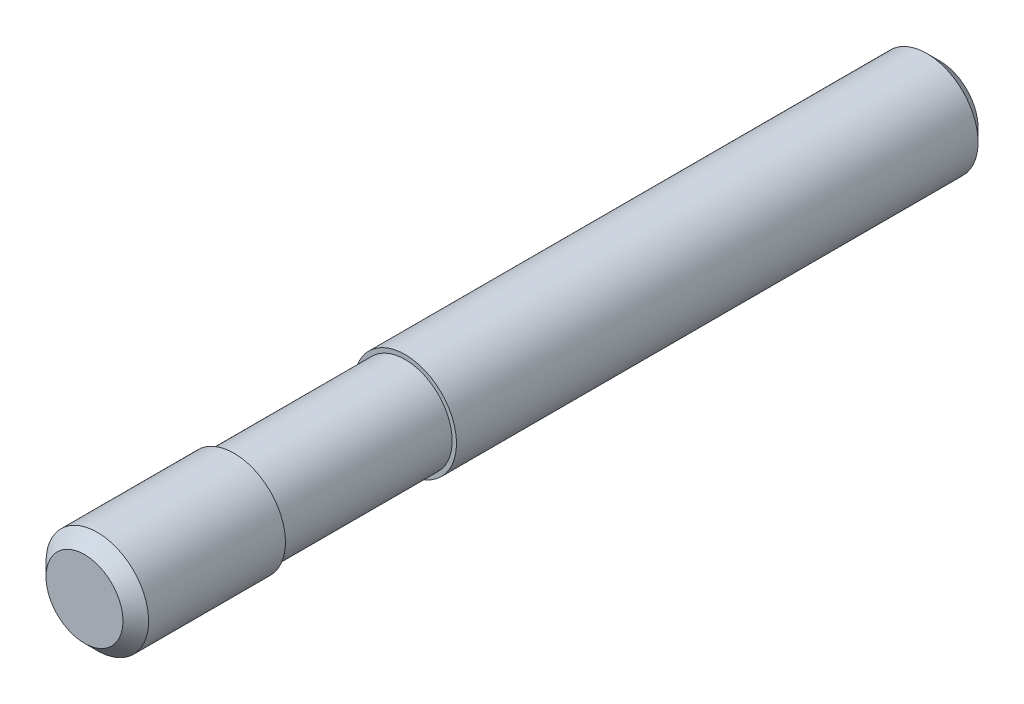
ISO-10303-21;
HEADER;
FILE_DESCRIPTION(('STEP AP214'),'2;1');
FILE_NAME('part.step','',(''),(''),'','','');
FILE_SCHEMA(('AUTOMOTIVE_DESIGN { 1 0 10303 214 1 1 1 1 }'));
ENDSEC;
DATA;
#1=APPLICATION_CONTEXT('core data for automotive mechanical design processes');
#2=APPLICATION_PROTOCOL_DEFINITION('international standard','automotive_design',2000,#1);
#3=PRODUCT_CONTEXT('',#1,'mechanical');
#4=PRODUCT('Part','Part','',(#3));
#5=PRODUCT_RELATED_PRODUCT_CATEGORY('part','',(#4));
#6=PRODUCT_DEFINITION_FORMATION('','',#4);
#7=PRODUCT_DEFINITION_CONTEXT('part definition',#1,'design');
#8=PRODUCT_DEFINITION('design','',#6,#7);
#9=PRODUCT_DEFINITION_SHAPE('','',#8);
#10=(LENGTH_UNIT() NAMED_UNIT(*) SI_UNIT(.MILLI.,.METRE.));
#11=(NAMED_UNIT(*) PLANE_ANGLE_UNIT() SI_UNIT($,.RADIAN.));
#12=(NAMED_UNIT(*) SI_UNIT($,.STERADIAN.) SOLID_ANGLE_UNIT());
#13=UNCERTAINTY_MEASURE_WITH_UNIT(LENGTH_MEASURE(1.E-05),#10,'distance_accuracy_value','');
#14=(GEOMETRIC_REPRESENTATION_CONTEXT(3) GLOBAL_UNCERTAINTY_ASSIGNED_CONTEXT((#13)) GLOBAL_UNIT_ASSIGNED_CONTEXT((#10,
#11,#12)) REPRESENTATION_CONTEXT('',''));
#15=CARTESIAN_POINT('',(0.,0.,0.));
#16=DIRECTION('',(0.,0.,1.));
#17=DIRECTION('',(1.,0.,0.));
#18=AXIS2_PLACEMENT_3D('',#15,#16,#17);
#19=CARTESIAN_POINT('',(-9.,0.,0.));
#20=DIRECTION('',(0.,0.,-1.));
#21=DIRECTION('',(-1.,0.,0.));
#22=AXIS2_PLACEMENT_3D('',#19,#20,#21);
#23=PLANE('',#22);
#24=CARTESIAN_POINT('',(0.,0.,0.));
#25=DIRECTION('',(0.,0.,-1.));
#26=DIRECTION('',(-1.,0.,0.));
#27=AXIS2_PLACEMENT_3D('',#24,#25,#26);
#28=CIRCLE('',#27,9.);
#29=CARTESIAN_POINT('',(-9.,0.,0.));
#30=VERTEX_POINT('',#29);
#31=EDGE_CURVE('E8',#30,#30,#28,.T.);
#32=ORIENTED_EDGE('',*,*,#31,.T.);
#33=EDGE_LOOP('',(#32));
#34=FACE_BOUND('',#33,.T.);
#35=ADVANCED_FACE('F12',(#34),#23,.T.);
#36=CARTESIAN_POINT('',(0.,0.,0.));
#37=DIRECTION('',(0.,0.,1.));
#38=DIRECTION('',(1.,0.,0.));
#39=AXIS2_PLACEMENT_3D('',#36,#37,#38);
#40=CONICAL_SURFACE('',#39,9.,0.785398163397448);
#41=CARTESIAN_POINT('',(0.,0.,3.));
#42=DIRECTION('',(0.,0.,-1.));
#43=DIRECTION('',(-1.,0.,0.));
#44=AXIS2_PLACEMENT_3D('',#41,#42,#43);
#45=CIRCLE('',#44,12.);
#46=CARTESIAN_POINT('',(-12.,0.,3.));
#47=VERTEX_POINT('',#46);
#48=EDGE_CURVE('E18',#47,#47,#45,.T.);
#49=ORIENTED_EDGE('',*,*,#48,.T.);
#50=EDGE_LOOP('',(#49));
#51=FACE_BOUND('',#50,.T.);
#52=ORIENTED_EDGE('',*,*,#31,.F.);
#53=EDGE_LOOP('',(#52));
#54=FACE_BOUND('',#53,.T.);
#55=ADVANCED_FACE('F57',(#51,#54),#40,.T.);
#56=CARTESIAN_POINT('',(0.,0.,0.));
#57=DIRECTION('',(0.,0.,-1.));
#58=DIRECTION('',(-1.,0.,0.));
#59=AXIS2_PLACEMENT_3D('',#56,#57,#58);
#60=CYLINDRICAL_SURFACE('',#59,12.);
#61=CARTESIAN_POINT('',(0.,0.,125.));
#62=DIRECTION('',(0.,0.,-1.));
#63=DIRECTION('',(-1.,0.,0.));
#64=AXIS2_PLACEMENT_3D('',#61,#62,#63);
#65=CIRCLE('',#64,12.);
#66=CARTESIAN_POINT('',(-12.,0.,125.));
#67=VERTEX_POINT('',#66);
#68=EDGE_CURVE('E22',#67,#67,#65,.T.);
#69=ORIENTED_EDGE('',*,*,#68,.T.);
#70=EDGE_LOOP('',(#69));
#71=FACE_BOUND('',#70,.T.);
#72=ORIENTED_EDGE('',*,*,#48,.F.);
#73=EDGE_LOOP('',(#72));
#74=FACE_BOUND('',#73,.T.);
#75=ADVANCED_FACE('F61',(#71,#74),#60,.T.);
#76=CARTESIAN_POINT('',(-11.,0.,125.));
#77=DIRECTION('',(0.,0.,1.));
#78=DIRECTION('',(1.,0.,0.));
#79=AXIS2_PLACEMENT_3D('',#76,#77,#78);
#80=PLANE('',#79);
#81=CARTESIAN_POINT('',(0.,0.,125.));
#82=DIRECTION('',(0.,0.,-1.));
#83=DIRECTION('',(-1.,0.,0.));
#84=AXIS2_PLACEMENT_3D('',#81,#82,#83);
#85=CIRCLE('',#84,11.);
#86=CARTESIAN_POINT('',(-11.,0.,125.));
#87=VERTEX_POINT('',#86);
#88=EDGE_CURVE('E26',#87,#87,#85,.T.);
#89=ORIENTED_EDGE('',*,*,#88,.T.);
#90=EDGE_LOOP('',(#89));
#91=FACE_BOUND('',#90,.T.);
#92=ORIENTED_EDGE('',*,*,#68,.F.);
#93=EDGE_LOOP('',(#92));
#94=FACE_BOUND('',#93,.T.);
#95=ADVANCED_FACE('F65',(#91,#94),#80,.T.);
#96=CARTESIAN_POINT('',(0.,0.,0.));
#97=DIRECTION('',(0.,0.,-1.));
#98=DIRECTION('',(-1.,0.,0.));
#99=AXIS2_PLACEMENT_3D('',#96,#97,#98);
#100=CYLINDRICAL_SURFACE('',#99,11.);
#101=CARTESIAN_POINT('',(0.,0.,165.));
#102=DIRECTION('',(0.,0.,-1.));
#103=DIRECTION('',(-1.,0.,0.));
#104=AXIS2_PLACEMENT_3D('',#101,#102,#103);
#105=CIRCLE('',#104,11.);
#106=CARTESIAN_POINT('',(-11.,0.,165.));
#107=VERTEX_POINT('',#106);
#108=EDGE_CURVE('E31',#107,#107,#105,.T.);
#109=ORIENTED_EDGE('',*,*,#108,.T.);
#110=EDGE_LOOP('',(#109));
#111=FACE_BOUND('',#110,.T.);
#112=ORIENTED_EDGE('',*,*,#88,.F.);
#113=EDGE_LOOP('',(#112));
#114=FACE_BOUND('',#113,.T.);
#115=ADVANCED_FACE('F72',(#111,#114),#100,.T.);
#116=CARTESIAN_POINT('',(-12.,0.,165.));
#117=DIRECTION('',(0.,0.,-1.));
#118=DIRECTION('',(-1.,0.,0.));
#119=AXIS2_PLACEMENT_3D('',#116,#117,#118);
#120=PLANE('',#119);
#121=CARTESIAN_POINT('',(0.,0.,165.));
#122=DIRECTION('',(0.,0.,-1.));
#123=DIRECTION('',(-1.,0.,0.));
#124=AXIS2_PLACEMENT_3D('',#121,#122,#123);
#125=CIRCLE('',#124,12.);
#126=CARTESIAN_POINT('',(-12.,0.,165.));
#127=VERTEX_POINT('',#126);
#128=EDGE_CURVE('E34',#127,#127,#125,.T.);
#129=ORIENTED_EDGE('',*,*,#128,.T.);
#130=EDGE_LOOP('',(#129));
#131=FACE_BOUND('',#130,.T.);
#132=ORIENTED_EDGE('',*,*,#108,.F.);
#133=EDGE_LOOP('',(#132));
#134=FACE_BOUND('',#133,.T.);
#135=ADVANCED_FACE('F76',(#131,#134),#120,.T.);
#136=CARTESIAN_POINT('',(0.,0.,0.));
#137=DIRECTION('',(0.,0.,-1.));
#138=DIRECTION('',(-1.,0.,0.));
#139=AXIS2_PLACEMENT_3D('',#136,#137,#138);
#140=CYLINDRICAL_SURFACE('',#139,12.);
#141=CARTESIAN_POINT('',(0.,0.,197.));
#142=DIRECTION('',(0.,0.,-1.));
#143=DIRECTION('',(-1.,0.,0.));
#144=AXIS2_PLACEMENT_3D('',#141,#142,#143);
#145=CIRCLE('',#144,12.);
#146=CARTESIAN_POINT('',(-12.,0.,197.));
#147=VERTEX_POINT('',#146);
#148=EDGE_CURVE('E37',#147,#147,#145,.T.);
#149=ORIENTED_EDGE('',*,*,#148,.T.);
#150=EDGE_LOOP('',(#149));
#151=FACE_BOUND('',#150,.T.);
#152=ORIENTED_EDGE('',*,*,#128,.F.);
#153=EDGE_LOOP('',(#152));
#154=FACE_BOUND('',#153,.T.);
#155=ADVANCED_FACE('F54',(#151,#154),#140,.T.);
#156=CARTESIAN_POINT('',(0.,0.,197.));
#157=DIRECTION('',(0.,0.,-1.));
#158=DIRECTION('',(-1.,0.,0.));
#159=AXIS2_PLACEMENT_3D('',#156,#157,#158);
#160=CONICAL_SURFACE('',#159,12.,0.785398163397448);
#161=CARTESIAN_POINT('',(0.,0.,200.));
#162=DIRECTION('',(0.,0.,-1.));
#163=DIRECTION('',(-1.,0.,0.));
#164=AXIS2_PLACEMENT_3D('',#161,#162,#163);
#165=CIRCLE('',#164,9.);
#166=CARTESIAN_POINT('',(-9.,0.,200.));
#167=VERTEX_POINT('',#166);
#168=EDGE_CURVE('E40',#167,#167,#165,.T.);
#169=ORIENTED_EDGE('',*,*,#168,.T.);
#170=EDGE_LOOP('',(#169));
#171=FACE_BOUND('',#170,.T.);
#172=ORIENTED_EDGE('',*,*,#148,.F.);
#173=EDGE_LOOP('',(#172));
#174=FACE_BOUND('',#173,.T.);
#175=ADVANCED_FACE('F44',(#171,#174),#160,.T.);
#176=CARTESIAN_POINT('',(0.,0.,200.));
#177=DIRECTION('',(0.,0.,1.));
#178=DIRECTION('',(1.,0.,0.));
#179=AXIS2_PLACEMENT_3D('',#176,#177,#178);
#180=PLANE('',#179);
#181=ORIENTED_EDGE('',*,*,#168,.F.);
#182=EDGE_LOOP('',(#181));
#183=FACE_BOUND('',#182,.T.);
#184=ADVANCED_FACE('F47',(#183),#180,.T.);
#185=CLOSED_SHELL('',(#35,#55,#75,#95,#115,#135,#155,#175,#184));
#186=MANIFOLD_SOLID_BREP('B1',#185);
#187=ADVANCED_BREP_SHAPE_REPRESENTATION('',(#18,#186),#14);
#188=SHAPE_DEFINITION_REPRESENTATION(#9,#187);
ENDSEC;
END-ISO-10303-21;
